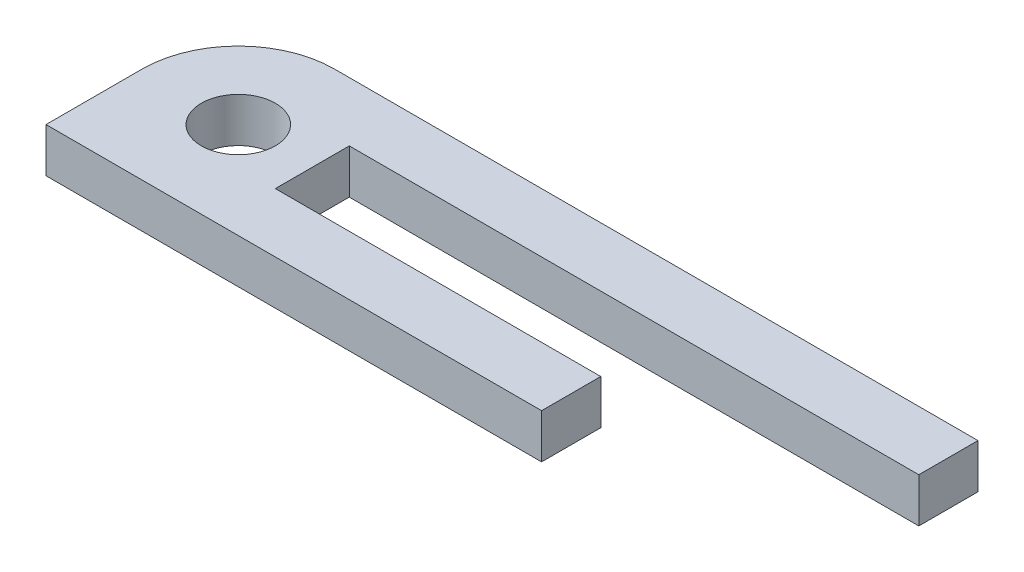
ISO-10303-21;
HEADER;
FILE_DESCRIPTION(('STEP AP214'),'2;1');
FILE_NAME('part.step','',(''),(''),'','','');
FILE_SCHEMA(('AUTOMOTIVE_DESIGN { 1 0 10303 214 1 1 1 1 }'));
ENDSEC;
DATA;
#1=APPLICATION_CONTEXT('core data for automotive mechanical design processes');
#2=APPLICATION_PROTOCOL_DEFINITION('international standard','automotive_design',2000,#1);
#3=PRODUCT_CONTEXT('',#1,'mechanical');
#4=PRODUCT('Part','Part','',(#3));
#5=PRODUCT_RELATED_PRODUCT_CATEGORY('part','',(#4));
#6=PRODUCT_DEFINITION_FORMATION('','',#4);
#7=PRODUCT_DEFINITION_CONTEXT('part definition',#1,'design');
#8=PRODUCT_DEFINITION('design','',#6,#7);
#9=PRODUCT_DEFINITION_SHAPE('','',#8);
#10=(LENGTH_UNIT() NAMED_UNIT(*) SI_UNIT(.MILLI.,.METRE.));
#11=(NAMED_UNIT(*) PLANE_ANGLE_UNIT() SI_UNIT($,.RADIAN.));
#12=(NAMED_UNIT(*) SI_UNIT($,.STERADIAN.) SOLID_ANGLE_UNIT());
#13=UNCERTAINTY_MEASURE_WITH_UNIT(LENGTH_MEASURE(1.E-05),#10,'distance_accuracy_value','');
#14=(GEOMETRIC_REPRESENTATION_CONTEXT(3) GLOBAL_UNCERTAINTY_ASSIGNED_CONTEXT((#13)) GLOBAL_UNIT_ASSIGNED_CONTEXT((#10,
#11,#12)) REPRESENTATION_CONTEXT('',''));
#15=CARTESIAN_POINT('',(0.,0.,0.));
#16=DIRECTION('',(0.,0.,1.));
#17=DIRECTION('',(1.,0.,0.));
#18=AXIS2_PLACEMENT_3D('',#15,#16,#17);
#19=CARTESIAN_POINT('',(13.,6.,-13.));
#20=DIRECTION('',(0.,1.,0.));
#21=DIRECTION('',(0.,0.,1.));
#22=AXIS2_PLACEMENT_3D('',#19,#20,#21);
#23=PLANE('',#22);
#24=DIRECTION('',(0.,0.,1.));
#25=VECTOR('',#24,1.);
#26=CARTESIAN_POINT('',(0.,6.,0.));
#27=LINE('',#26,#25);
#28=CARTESIAN_POINT('',(0.,6.,-13.));
#29=VERTEX_POINT('',#28);
#30=CARTESIAN_POINT('',(0.,6.,0.));
#31=VERTEX_POINT('',#30);
#32=EDGE_CURVE('E140',#29,#31,#27,.T.);
#33=ORIENTED_EDGE('',*,*,#32,.T.);
#34=DIRECTION('',(1.,0.,0.));
#35=VECTOR('',#34,1.);
#36=CARTESIAN_POINT('',(0.,6.,0.));
#37=LINE('',#36,#35);
#38=CARTESIAN_POINT('',(67.,6.,0.));
#39=VERTEX_POINT('',#38);
#40=EDGE_CURVE('E115',#31,#39,#37,.T.);
#41=ORIENTED_EDGE('',*,*,#40,.T.);
#42=DIRECTION('',(0.,0.,-1.));
#43=VECTOR('',#42,1.);
#44=CARTESIAN_POINT('',(67.,6.,0.));
#45=LINE('',#44,#43);
#46=CARTESIAN_POINT('',(67.,6.,-8.));
#47=VERTEX_POINT('',#46);
#48=EDGE_CURVE('E143',#39,#47,#45,.T.);
#49=ORIENTED_EDGE('',*,*,#48,.T.);
#50=DIRECTION('',(-1.,0.,0.));
#51=VECTOR('',#50,1.);
#52=CARTESIAN_POINT('',(23.,6.,-8.));
#53=LINE('',#52,#51);
#54=CARTESIAN_POINT('',(23.,6.,-8.));
#55=VERTEX_POINT('',#54);
#56=EDGE_CURVE('E145',#47,#55,#53,.T.);
#57=ORIENTED_EDGE('',*,*,#56,.T.);
#58=DIRECTION('',(0.,0.,-1.));
#59=VECTOR('',#58,1.);
#60=CARTESIAN_POINT('',(23.,6.,-8.));
#61=LINE('',#60,#59);
#62=CARTESIAN_POINT('',(23.,6.,-18.));
#63=VERTEX_POINT('',#62);
#64=EDGE_CURVE('E147',#55,#63,#61,.T.);
#65=ORIENTED_EDGE('',*,*,#64,.T.);
#66=DIRECTION('',(1.,0.,0.));
#67=VECTOR('',#66,1.);
#68=CARTESIAN_POINT('',(23.,6.,-18.));
#69=LINE('',#68,#67);
#70=CARTESIAN_POINT('',(100.,6.,-18.));
#71=VERTEX_POINT('',#70);
#72=EDGE_CURVE('E149',#63,#71,#69,.T.);
#73=ORIENTED_EDGE('',*,*,#72,.T.);
#74=DIRECTION('',(0.,0.,-1.));
#75=VECTOR('',#74,1.);
#76=CARTESIAN_POINT('',(100.,6.,-18.));
#77=LINE('',#76,#75);
#78=CARTESIAN_POINT('',(100.,6.,-26.));
#79=VERTEX_POINT('',#78);
#80=EDGE_CURVE('E151',#71,#79,#77,.T.);
#81=ORIENTED_EDGE('',*,*,#80,.T.);
#82=DIRECTION('',(-1.,0.,0.));
#83=VECTOR('',#82,1.);
#84=CARTESIAN_POINT('',(13.,6.,-26.));
#85=LINE('',#84,#83);
#86=CARTESIAN_POINT('',(13.,6.,-26.));
#87=VERTEX_POINT('',#86);
#88=EDGE_CURVE('E50',#79,#87,#85,.T.);
#89=ORIENTED_EDGE('',*,*,#88,.T.);
#90=CARTESIAN_POINT('',(13.,6.,-13.));
#91=DIRECTION('',(0.,1.,0.));
#92=DIRECTION('',(0.,0.,1.));
#93=AXIS2_PLACEMENT_3D('',#90,#91,#92);
#94=CIRCLE('',#93,13.);
#95=EDGE_CURVE('E45',#87,#29,#94,.T.);
#96=ORIENTED_EDGE('',*,*,#95,.T.);
#97=EDGE_LOOP('',(#33,#41,#49,#57,#65,#73,#81,#89,#96));
#98=FACE_BOUND('',#97,.T.);
#99=CARTESIAN_POINT('',(13.,6.,-13.));
#100=DIRECTION('',(0.,1.,0.));
#101=DIRECTION('',(0.,0.,1.));
#102=AXIS2_PLACEMENT_3D('',#99,#100,#101);
#103=CIRCLE('',#102,5.);
#104=CARTESIAN_POINT('',(13.,6.,-8.));
#105=VERTEX_POINT('',#104);
#106=EDGE_CURVE('E120',#105,#105,#103,.T.);
#107=ORIENTED_EDGE('',*,*,#106,.F.);
#108=EDGE_LOOP('',(#107));
#109=FACE_BOUND('',#108,.T.);
#110=ADVANCED_FACE('F30',(#98,#109),#23,.T.);
#111=CARTESIAN_POINT('',(13.,0.,-13.));
#112=DIRECTION('',(0.,1.,0.));
#113=DIRECTION('',(0.,0.,1.));
#114=AXIS2_PLACEMENT_3D('',#111,#112,#113);
#115=PLANE('',#114);
#116=DIRECTION('',(0.,0.,1.));
#117=VECTOR('',#116,1.);
#118=CARTESIAN_POINT('',(0.,0.,0.));
#119=LINE('',#118,#117);
#120=CARTESIAN_POINT('',(0.,0.,-13.));
#121=VERTEX_POINT('',#120);
#122=CARTESIAN_POINT('',(0.,0.,0.));
#123=VERTEX_POINT('',#122);
#124=EDGE_CURVE('E106',#121,#123,#119,.T.);
#125=ORIENTED_EDGE('',*,*,#124,.F.);
#126=CARTESIAN_POINT('',(13.,0.,-13.));
#127=DIRECTION('',(0.,1.,0.));
#128=DIRECTION('',(0.,0.,1.));
#129=AXIS2_PLACEMENT_3D('',#126,#127,#128);
#130=CIRCLE('',#129,13.);
#131=CARTESIAN_POINT('',(13.,0.,-26.));
#132=VERTEX_POINT('',#131);
#133=EDGE_CURVE('E138',#132,#121,#130,.T.);
#134=ORIENTED_EDGE('',*,*,#133,.F.);
#135=DIRECTION('',(-1.,0.,0.));
#136=VECTOR('',#135,1.);
#137=CARTESIAN_POINT('',(13.,0.,-26.));
#138=LINE('',#137,#136);
#139=CARTESIAN_POINT('',(100.,0.,-26.));
#140=VERTEX_POINT('',#139);
#141=EDGE_CURVE('E136',#140,#132,#138,.T.);
#142=ORIENTED_EDGE('',*,*,#141,.F.);
#143=DIRECTION('',(0.,0.,-1.));
#144=VECTOR('',#143,1.);
#145=CARTESIAN_POINT('',(100.,0.,-18.));
#146=LINE('',#145,#144);
#147=CARTESIAN_POINT('',(100.,0.,-18.));
#148=VERTEX_POINT('',#147);
#149=EDGE_CURVE('E134',#148,#140,#146,.T.);
#150=ORIENTED_EDGE('',*,*,#149,.F.);
#151=DIRECTION('',(1.,0.,0.));
#152=VECTOR('',#151,1.);
#153=CARTESIAN_POINT('',(23.,0.,-18.));
#154=LINE('',#153,#152);
#155=CARTESIAN_POINT('',(23.,0.,-18.));
#156=VERTEX_POINT('',#155);
#157=EDGE_CURVE('E132',#156,#148,#154,.T.);
#158=ORIENTED_EDGE('',*,*,#157,.F.);
#159=DIRECTION('',(0.,0.,-1.));
#160=VECTOR('',#159,1.);
#161=CARTESIAN_POINT('',(23.,0.,-8.));
#162=LINE('',#161,#160);
#163=CARTESIAN_POINT('',(23.,0.,-8.));
#164=VERTEX_POINT('',#163);
#165=EDGE_CURVE('E130',#164,#156,#162,.T.);
#166=ORIENTED_EDGE('',*,*,#165,.F.);
#167=DIRECTION('',(-1.,0.,0.));
#168=VECTOR('',#167,1.);
#169=CARTESIAN_POINT('',(23.,0.,-8.));
#170=LINE('',#169,#168);
#171=CARTESIAN_POINT('',(67.,0.,-8.));
#172=VERTEX_POINT('',#171);
#173=EDGE_CURVE('E128',#172,#164,#170,.T.);
#174=ORIENTED_EDGE('',*,*,#173,.F.);
#175=DIRECTION('',(0.,0.,-1.));
#176=VECTOR('',#175,1.);
#177=CARTESIAN_POINT('',(67.,0.,0.));
#178=LINE('',#177,#176);
#179=CARTESIAN_POINT('',(67.,0.,0.));
#180=VERTEX_POINT('',#179);
#181=EDGE_CURVE('E108',#180,#172,#178,.T.);
#182=ORIENTED_EDGE('',*,*,#181,.F.);
#183=DIRECTION('',(1.,0.,0.));
#184=VECTOR('',#183,1.);
#185=CARTESIAN_POINT('',(0.,0.,0.));
#186=LINE('',#185,#184);
#187=EDGE_CURVE('E101',#123,#180,#186,.T.);
#188=ORIENTED_EDGE('',*,*,#187,.F.);
#189=EDGE_LOOP('',(#125,#134,#142,#150,#158,#166,#174,#182,#188));
#190=FACE_BOUND('',#189,.T.);
#191=CARTESIAN_POINT('',(13.,0.,-13.));
#192=DIRECTION('',(0.,1.,0.));
#193=DIRECTION('',(0.,0.,1.));
#194=AXIS2_PLACEMENT_3D('',#191,#192,#193);
#195=CIRCLE('',#194,5.);
#196=CARTESIAN_POINT('',(13.,0.,-8.));
#197=VERTEX_POINT('',#196);
#198=EDGE_CURVE('E123',#197,#197,#195,.T.);
#199=ORIENTED_EDGE('',*,*,#198,.T.);
#200=EDGE_LOOP('',(#199));
#201=FACE_BOUND('',#200,.T.);
#202=ADVANCED_FACE('F102',(#190,#201),#115,.F.);
#203=CARTESIAN_POINT('',(0.,6.,0.));
#204=DIRECTION('',(1.,0.,0.));
#205=DIRECTION('',(0.,0.,-1.));
#206=AXIS2_PLACEMENT_3D('',#203,#204,#205);
#207=PLANE('',#206);
#208=ORIENTED_EDGE('',*,*,#124,.T.);
#209=DIRECTION('',(0.,-1.,0.));
#210=VECTOR('',#209,1.);
#211=CARTESIAN_POINT('',(0.,6.,0.));
#212=LINE('',#211,#210);
#213=EDGE_CURVE('E11',#31,#123,#212,.T.);
#214=ORIENTED_EDGE('',*,*,#213,.F.);
#215=ORIENTED_EDGE('',*,*,#32,.F.);
#216=DIRECTION('',(0.,-1.,0.));
#217=VECTOR('',#216,1.);
#218=CARTESIAN_POINT('',(0.,6.,-13.));
#219=LINE('',#218,#217);
#220=EDGE_CURVE('E119',#29,#121,#219,.T.);
#221=ORIENTED_EDGE('',*,*,#220,.T.);
#222=EDGE_LOOP('',(#208,#214,#215,#221));
#223=FACE_BOUND('',#222,.T.);
#224=ADVANCED_FACE('F32',(#223),#207,.F.);
#225=CARTESIAN_POINT('',(0.,6.,0.));
#226=DIRECTION('',(0.,0.,-1.));
#227=DIRECTION('',(-1.,0.,0.));
#228=AXIS2_PLACEMENT_3D('',#225,#226,#227);
#229=PLANE('',#228);
#230=ORIENTED_EDGE('',*,*,#187,.T.);
#231=DIRECTION('',(0.,-1.,0.));
#232=VECTOR('',#231,1.);
#233=CARTESIAN_POINT('',(67.,6.,0.));
#234=LINE('',#233,#232);
#235=EDGE_CURVE('E38',#39,#180,#234,.T.);
#236=ORIENTED_EDGE('',*,*,#235,.F.);
#237=ORIENTED_EDGE('',*,*,#40,.F.);
#238=ORIENTED_EDGE('',*,*,#213,.T.);
#239=EDGE_LOOP('',(#230,#236,#237,#238));
#240=FACE_BOUND('',#239,.T.);
#241=ADVANCED_FACE('F114',(#240),#229,.F.);
#242=CARTESIAN_POINT('',(67.,6.,0.));
#243=DIRECTION('',(-1.,0.,0.));
#244=DIRECTION('',(0.,0.,1.));
#245=AXIS2_PLACEMENT_3D('',#242,#243,#244);
#246=PLANE('',#245);
#247=ORIENTED_EDGE('',*,*,#181,.T.);
#248=DIRECTION('',(0.,-1.,0.));
#249=VECTOR('',#248,1.);
#250=CARTESIAN_POINT('',(67.,6.,-8.));
#251=LINE('',#250,#249);
#252=EDGE_CURVE('E171',#47,#172,#251,.T.);
#253=ORIENTED_EDGE('',*,*,#252,.F.);
#254=ORIENTED_EDGE('',*,*,#48,.F.);
#255=ORIENTED_EDGE('',*,*,#235,.T.);
#256=EDGE_LOOP('',(#247,#253,#254,#255));
#257=FACE_BOUND('',#256,.T.);
#258=ADVANCED_FACE('F175',(#257),#246,.F.);
#259=CARTESIAN_POINT('',(23.,6.,-8.));
#260=DIRECTION('',(0.,0.,1.));
#261=DIRECTION('',(1.,0.,0.));
#262=AXIS2_PLACEMENT_3D('',#259,#260,#261);
#263=PLANE('',#262);
#264=ORIENTED_EDGE('',*,*,#173,.T.);
#265=DIRECTION('',(0.,-1.,0.));
#266=VECTOR('',#265,1.);
#267=CARTESIAN_POINT('',(23.,6.,-8.));
#268=LINE('',#267,#266);
#269=EDGE_CURVE('E168',#55,#164,#268,.T.);
#270=ORIENTED_EDGE('',*,*,#269,.F.);
#271=ORIENTED_EDGE('',*,*,#56,.F.);
#272=ORIENTED_EDGE('',*,*,#252,.T.);
#273=EDGE_LOOP('',(#264,#270,#271,#272));
#274=FACE_BOUND('',#273,.T.);
#275=ADVANCED_FACE('F183',(#274),#263,.F.);
#276=CARTESIAN_POINT('',(23.,6.,-8.));
#277=DIRECTION('',(-1.,0.,0.));
#278=DIRECTION('',(0.,0.,1.));
#279=AXIS2_PLACEMENT_3D('',#276,#277,#278);
#280=PLANE('',#279);
#281=ORIENTED_EDGE('',*,*,#165,.T.);
#282=DIRECTION('',(0.,-1.,0.));
#283=VECTOR('',#282,1.);
#284=CARTESIAN_POINT('',(23.,6.,-18.));
#285=LINE('',#284,#283);
#286=EDGE_CURVE('E165',#63,#156,#285,.T.);
#287=ORIENTED_EDGE('',*,*,#286,.F.);
#288=ORIENTED_EDGE('',*,*,#64,.F.);
#289=ORIENTED_EDGE('',*,*,#269,.T.);
#290=EDGE_LOOP('',(#281,#287,#288,#289));
#291=FACE_BOUND('',#290,.T.);
#292=ADVANCED_FACE('F186',(#291),#280,.F.);
#293=CARTESIAN_POINT('',(23.,6.,-18.));
#294=DIRECTION('',(0.,0.,-1.));
#295=DIRECTION('',(-1.,0.,0.));
#296=AXIS2_PLACEMENT_3D('',#293,#294,#295);
#297=PLANE('',#296);
#298=ORIENTED_EDGE('',*,*,#157,.T.);
#299=DIRECTION('',(0.,-1.,0.));
#300=VECTOR('',#299,1.);
#301=CARTESIAN_POINT('',(100.,6.,-18.));
#302=LINE('',#301,#300);
#303=EDGE_CURVE('E162',#71,#148,#302,.T.);
#304=ORIENTED_EDGE('',*,*,#303,.F.);
#305=ORIENTED_EDGE('',*,*,#72,.F.);
#306=ORIENTED_EDGE('',*,*,#286,.T.);
#307=EDGE_LOOP('',(#298,#304,#305,#306));
#308=FACE_BOUND('',#307,.T.);
#309=ADVANCED_FACE('F191',(#308),#297,.F.);
#310=CARTESIAN_POINT('',(100.,6.,-18.));
#311=DIRECTION('',(-1.,0.,0.));
#312=DIRECTION('',(0.,0.,1.));
#313=AXIS2_PLACEMENT_3D('',#310,#311,#312);
#314=PLANE('',#313);
#315=ORIENTED_EDGE('',*,*,#149,.T.);
#316=DIRECTION('',(0.,-1.,0.));
#317=VECTOR('',#316,1.);
#318=CARTESIAN_POINT('',(100.,6.,-26.));
#319=LINE('',#318,#317);
#320=EDGE_CURVE('E159',#79,#140,#319,.T.);
#321=ORIENTED_EDGE('',*,*,#320,.F.);
#322=ORIENTED_EDGE('',*,*,#80,.F.);
#323=ORIENTED_EDGE('',*,*,#303,.T.);
#324=EDGE_LOOP('',(#315,#321,#322,#323));
#325=FACE_BOUND('',#324,.T.);
#326=ADVANCED_FACE('F195',(#325),#314,.F.);
#327=CARTESIAN_POINT('',(13.,6.,-26.));
#328=DIRECTION('',(0.,0.,1.));
#329=DIRECTION('',(1.,0.,0.));
#330=AXIS2_PLACEMENT_3D('',#327,#328,#329);
#331=PLANE('',#330);
#332=ORIENTED_EDGE('',*,*,#141,.T.);
#333=DIRECTION('',(0.,-1.,0.));
#334=VECTOR('',#333,1.);
#335=CARTESIAN_POINT('',(13.,6.,-26.));
#336=LINE('',#335,#334);
#337=EDGE_CURVE('E156',#87,#132,#336,.T.);
#338=ORIENTED_EDGE('',*,*,#337,.F.);
#339=ORIENTED_EDGE('',*,*,#88,.F.);
#340=ORIENTED_EDGE('',*,*,#320,.T.);
#341=EDGE_LOOP('',(#332,#338,#339,#340));
#342=FACE_BOUND('',#341,.T.);
#343=ADVANCED_FACE('F199',(#342),#331,.F.);
#344=CARTESIAN_POINT('',(13.,6.,-13.));
#345=DIRECTION('',(0.,-1.,0.));
#346=DIRECTION('',(0.,0.,-1.));
#347=AXIS2_PLACEMENT_3D('',#344,#345,#346);
#348=CYLINDRICAL_SURFACE('',#347,13.);
#349=ORIENTED_EDGE('',*,*,#133,.T.);
#350=ORIENTED_EDGE('',*,*,#220,.F.);
#351=ORIENTED_EDGE('',*,*,#95,.F.);
#352=ORIENTED_EDGE('',*,*,#337,.T.);
#353=EDGE_LOOP('',(#349,#350,#351,#352));
#354=FACE_BOUND('',#353,.T.);
#355=ADVANCED_FACE('F201',(#354),#348,.T.);
#356=CARTESIAN_POINT('',(13.,6.,-13.));
#357=DIRECTION('',(0.,-1.,0.));
#358=DIRECTION('',(0.,0.,-1.));
#359=AXIS2_PLACEMENT_3D('',#356,#357,#358);
#360=CYLINDRICAL_SURFACE('',#359,5.);
#361=ORIENTED_EDGE('',*,*,#106,.T.);
#362=EDGE_LOOP('',(#361));
#363=FACE_BOUND('',#362,.T.);
#364=ORIENTED_EDGE('',*,*,#198,.F.);
#365=EDGE_LOOP('',(#364));
#366=FACE_BOUND('',#365,.T.);
#367=ADVANCED_FACE('F203',(#363,#366),#360,.F.);
#368=CLOSED_SHELL('',(#110,#202,#224,#241,#258,#275,#292,#309,#326,#343,#355,#367));
#369=MANIFOLD_SOLID_BREP('B2',#368);
#370=ADVANCED_BREP_SHAPE_REPRESENTATION('',(#18,#369),#14);
#371=SHAPE_DEFINITION_REPRESENTATION(#9,#370);
ENDSEC;
END-ISO-10303-21;
